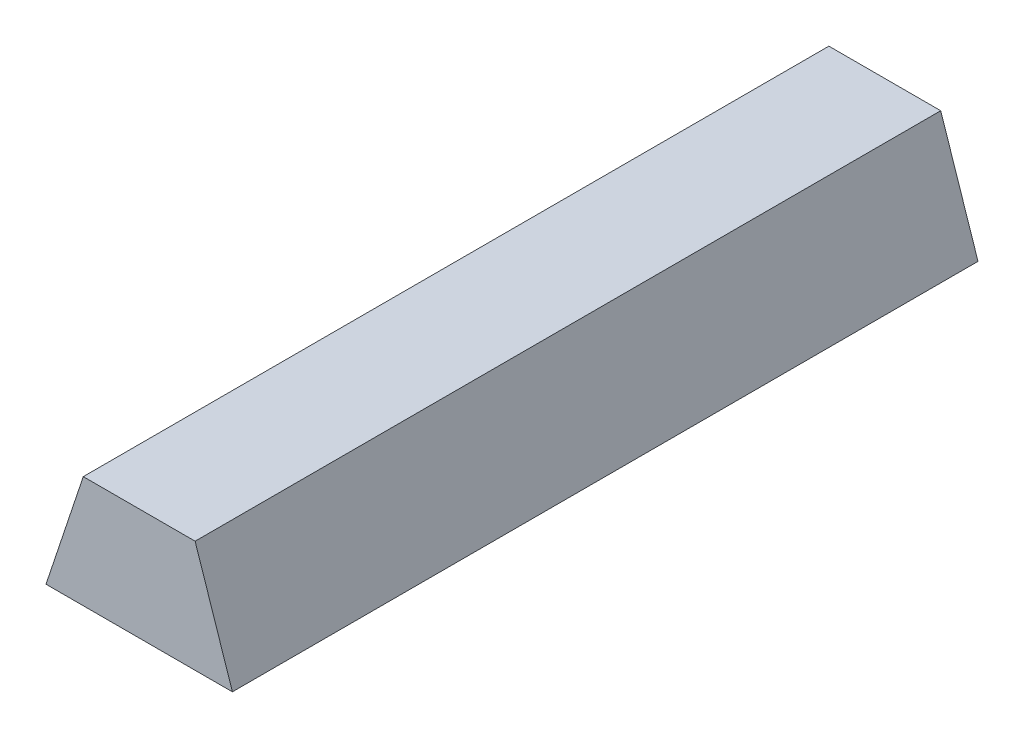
from build123d import *

# Parameters (mm, degrees)
EXTRUDE_1_DEPTH = 2000


with BuildPart() as part:
    # Sketch 1 → Extrude 1 (new body)
    with BuildSketch(Plane.XY):
        Polygon((150, 150), (250, -150), (-250, -150), (-150, 150), align=None)
    extrude(amount=EXTRUDE_1_DEPTH)


solid = part.part
